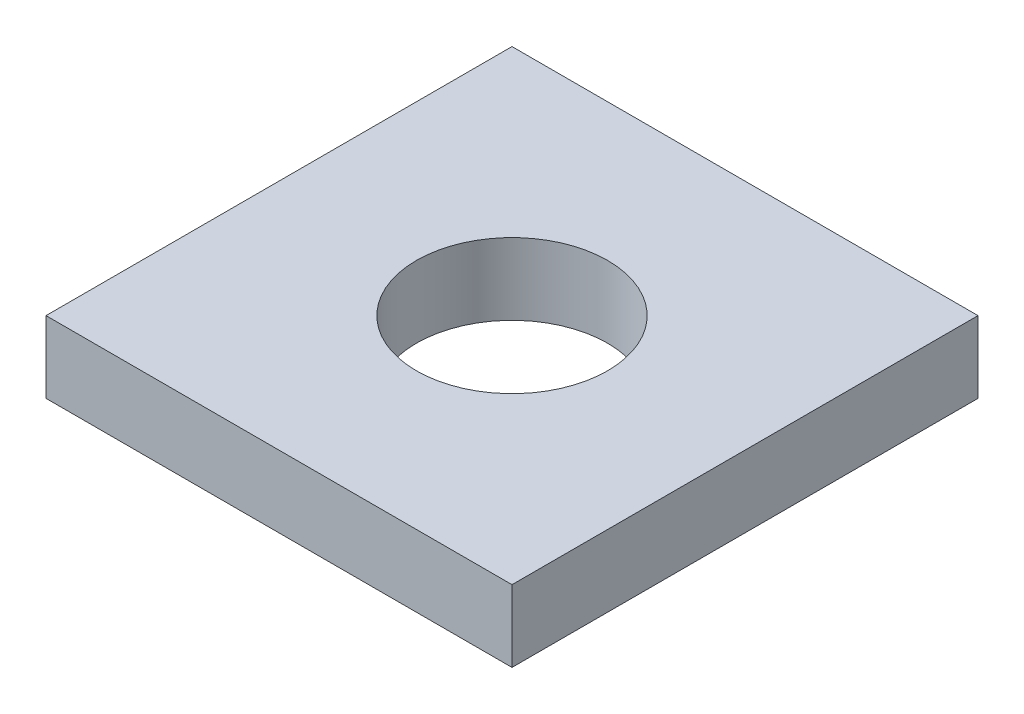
from build123d import *

# Parameters (mm, degrees)
SKETCH1_W           = 9.75
SKETCH1_H           = 9.75
SKETCH1_R           = 2
BOSS_EXTRUDE2_DEPTH = 1.5


with BuildPart() as part:
    # Sketch1 → Boss-Extrude2 (new body)
    with BuildSketch(Plane(origin=(0, 0, 0), x_dir=(1, 0, 0), z_dir=(0, 1, 0))):
        with Locations((4.875, 4.875)):
            Rectangle(SKETCH1_W, SKETCH1_H)
        with Locations(Location((4.875, 4.875, 0), (0, 0, 270))):
            Circle(SKETCH1_R, mode=Mode.SUBTRACT)
    extrude(amount=BOSS_EXTRUDE2_DEPTH)


solid = part.part
